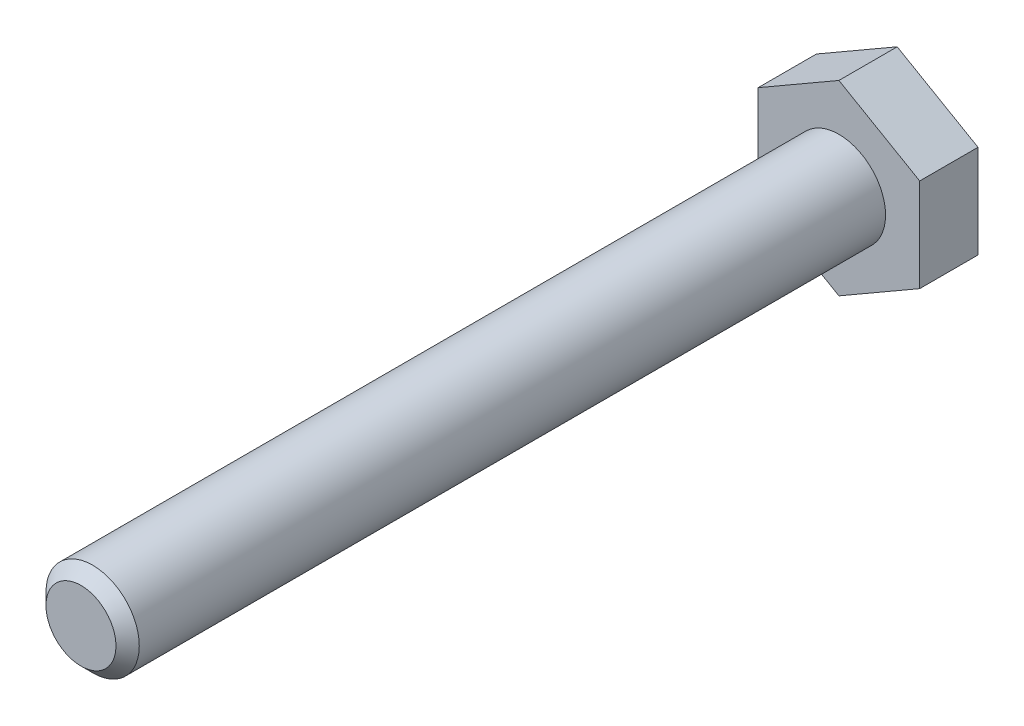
from build123d import *

# Parameters (mm, degrees)
BASE_EXTRUSION_DEPTH    = 70
ESQUISSE2_OUTSIDE_W     = 30.482
ESQUISSE2_OUTSIDE_H     = 32.626
ESQUISSE2_OUTSIDE_R     = 4
ENL_V_MAT_EXTRU_1_DEPTH = 65
CHANFREIN1_SIZE         = 1


with BuildPart() as part:
    # Esquisse1 → Base-Extrusion (new body)
    with BuildSketch(Plane.XY):
        Polygon((0, 8), (-6.92820323, 4), (-6.92820323, -4), (0, -8), (6.92820323, -4), (6.92820323, 4), align=None)
    extrude(amount=BASE_EXTRUSION_DEPTH)

    # Esquisse2 outside → Enl_v. mat.-Extru.1 (cut)
    with BuildSketch(Plane.XY.offset(70)):
        Rectangle(ESQUISSE2_OUTSIDE_W, ESQUISSE2_OUTSIDE_H)
        Circle(ESQUISSE2_OUTSIDE_R, mode=Mode.SUBTRACT)
    extrude(amount=-ENL_V_MAT_EXTRU_1_DEPTH, mode=Mode.SUBTRACT)

    # Chanfrein1
    chanfrein1_edges = [part.edges().sort_by_distance(p)[0] for p in [
        (-4, 0, 70),
    ]]
    chamfer(chanfrein1_edges, length=CHANFREIN1_SIZE)


solid = part.part
